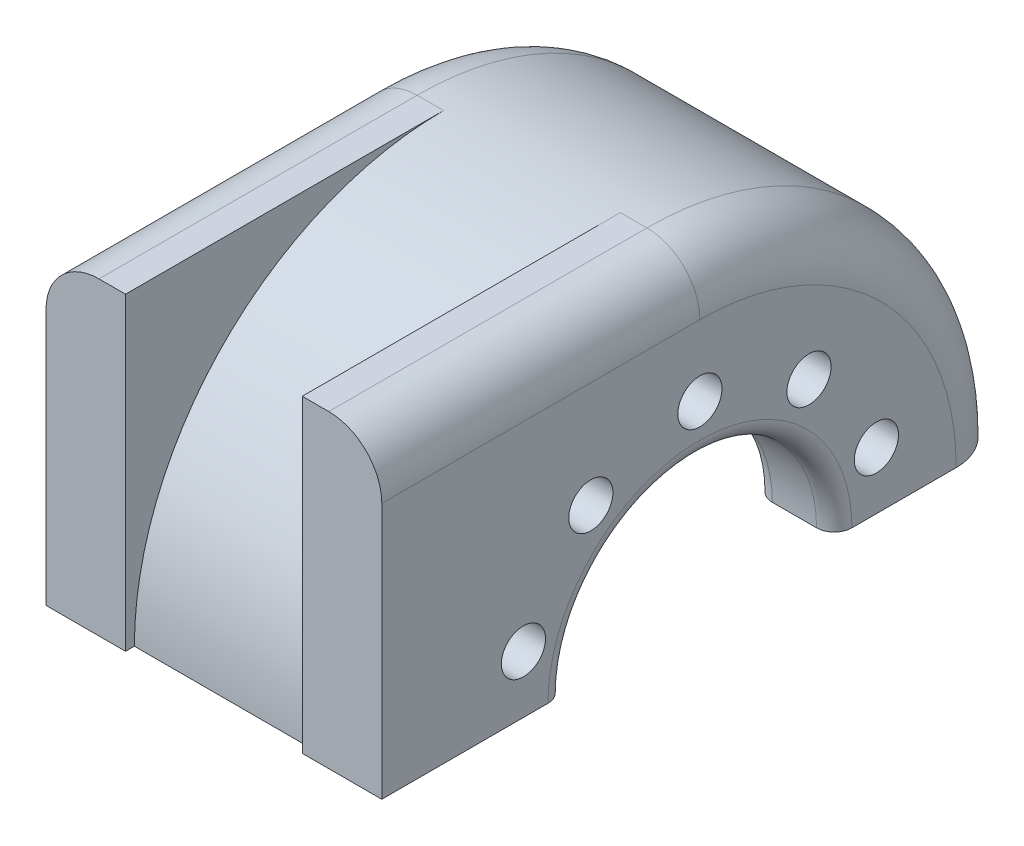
ISO-10303-21;
HEADER;
FILE_DESCRIPTION(('STEP AP214'),'2;1');
FILE_NAME('part.step','',(''),(''),'','','');
FILE_SCHEMA(('AUTOMOTIVE_DESIGN { 1 0 10303 214 1 1 1 1 }'));
ENDSEC;
DATA;
#1=APPLICATION_CONTEXT('core data for automotive mechanical design processes');
#2=APPLICATION_PROTOCOL_DEFINITION('international standard','automotive_design',2000,#1);
#3=PRODUCT_CONTEXT('',#1,'mechanical');
#4=PRODUCT('Part','Part','',(#3));
#5=PRODUCT_RELATED_PRODUCT_CATEGORY('part','',(#4));
#6=PRODUCT_DEFINITION_FORMATION('','',#4);
#7=PRODUCT_DEFINITION_CONTEXT('part definition',#1,'design');
#8=PRODUCT_DEFINITION('design','',#6,#7);
#9=PRODUCT_DEFINITION_SHAPE('','',#8);
#10=(LENGTH_UNIT() NAMED_UNIT(*) SI_UNIT(.MILLI.,.METRE.));
#11=(NAMED_UNIT(*) PLANE_ANGLE_UNIT() SI_UNIT($,.RADIAN.));
#12=(NAMED_UNIT(*) SI_UNIT($,.STERADIAN.) SOLID_ANGLE_UNIT());
#13=UNCERTAINTY_MEASURE_WITH_UNIT(LENGTH_MEASURE(1.E-05),#10,'distance_accuracy_value','');
#14=(GEOMETRIC_REPRESENTATION_CONTEXT(3) GLOBAL_UNCERTAINTY_ASSIGNED_CONTEXT((#13)) GLOBAL_UNIT_ASSIGNED_CONTEXT((#10,
#11,#12)) REPRESENTATION_CONTEXT('',''));
#15=CARTESIAN_POINT('',(0.,0.,0.));
#16=DIRECTION('',(0.,0.,1.));
#17=DIRECTION('',(1.,0.,0.));
#18=AXIS2_PLACEMENT_3D('',#15,#16,#17);
#19=CARTESIAN_POINT('',(-190.,175.,180.));
#20=DIRECTION('',(0.,1.,0.));
#21=DIRECTION('',(0.,0.,1.));
#22=AXIS2_PLACEMENT_3D('',#19,#20,#21);
#23=PLANE('',#22);
#24=DIRECTION('',(1.,0.,0.));
#25=VECTOR('',#24,1.);
#26=CARTESIAN_POINT('',(-190.,175.,180.));
#27=LINE('',#26,#25);
#28=CARTESIAN_POINT('',(-160.,175.,180.));
#29=VERTEX_POINT('',#28);
#30=CARTESIAN_POINT('',(-145.,175.,180.));
#31=VERTEX_POINT('',#30);
#32=EDGE_CURVE('E214',#29,#31,#27,.T.);
#33=ORIENTED_EDGE('',*,*,#32,.T.);
#34=DIRECTION('',(0.,0.,1.));
#35=VECTOR('',#34,1.);
#36=CARTESIAN_POINT('',(-145.,175.,0.));
#37=LINE('',#36,#35);
#38=CARTESIAN_POINT('',(-145.,175.,0.));
#39=VERTEX_POINT('',#38);
#40=EDGE_CURVE('E455',#39,#31,#37,.T.);
#41=ORIENTED_EDGE('',*,*,#40,.F.);
#42=DIRECTION('',(1.,0.,0.));
#43=VECTOR('',#42,1.);
#44=CARTESIAN_POINT('',(-190.,175.,0.));
#45=LINE('',#44,#43);
#46=CARTESIAN_POINT('',(-160.,175.,0.));
#47=VERTEX_POINT('',#46);
#48=EDGE_CURVE('E213',#47,#39,#45,.T.);
#49=ORIENTED_EDGE('',*,*,#48,.F.);
#50=DIRECTION('',(0.,0.,1.));
#51=VECTOR('',#50,1.);
#52=CARTESIAN_POINT('',(-160.,175.,180.));
#53=LINE('',#52,#51);
#54=EDGE_CURVE('E279',#47,#29,#53,.T.);
#55=ORIENTED_EDGE('',*,*,#54,.T.);
#56=EDGE_LOOP('',(#33,#41,#49,#55));
#57=FACE_BOUND('',#56,.T.);
#58=ADVANCED_FACE('F37',(#57),#23,.T.);
#59=CARTESIAN_POINT('',(-190.,175.,180.));
#60=DIRECTION('',(0.,0.,1.));
#61=DIRECTION('',(0.,-1.,0.));
#62=AXIS2_PLACEMENT_3D('',#59,#60,#61);
#63=PLANE('',#62);
#64=DIRECTION('',(1.,0.,0.));
#65=VECTOR('',#64,1.);
#66=CARTESIAN_POINT('',(-190.,0.,180.));
#67=LINE('',#66,#65);
#68=CARTESIAN_POINT('',(-190.,0.,180.));
#69=VERTEX_POINT('',#68);
#70=CARTESIAN_POINT('',(-145.,0.,180.));
#71=VERTEX_POINT('',#70);
#72=EDGE_CURVE('E343',#69,#71,#67,.T.);
#73=ORIENTED_EDGE('',*,*,#72,.T.);
#74=DIRECTION('',(0.,-1.,0.));
#75=VECTOR('',#74,1.);
#76=CARTESIAN_POINT('',(-145.,175.,180.));
#77=LINE('',#76,#75);
#78=EDGE_CURVE('E54',#31,#71,#77,.T.);
#79=ORIENTED_EDGE('',*,*,#78,.F.);
#80=ORIENTED_EDGE('',*,*,#32,.F.);
#81=CARTESIAN_POINT('',(-160.,145.,180.));
#82=DIRECTION('',(0.,0.,1.));
#83=DIRECTION('',(0.,-1.,0.));
#84=AXIS2_PLACEMENT_3D('',#81,#82,#83);
#85=CIRCLE('',#84,30.);
#86=CARTESIAN_POINT('',(-190.,145.,180.));
#87=VERTEX_POINT('',#86);
#88=EDGE_CURVE('E285',#29,#87,#85,.T.);
#89=ORIENTED_EDGE('',*,*,#88,.T.);
#90=DIRECTION('',(0.,-1.,0.));
#91=VECTOR('',#90,1.);
#92=CARTESIAN_POINT('',(-190.,175.,180.));
#93=LINE('',#92,#91);
#94=EDGE_CURVE('E374',#87,#69,#93,.T.);
#95=ORIENTED_EDGE('',*,*,#94,.T.);
#96=EDGE_LOOP('',(#73,#79,#80,#89,#95));
#97=FACE_BOUND('',#96,.T.);
#98=ADVANCED_FACE('F474',(#97),#63,.T.);
#99=CARTESIAN_POINT('',(-190.,0.,0.));
#100=DIRECTION('',(1.,0.,0.));
#101=DIRECTION('',(0.,0.,-1.));
#102=AXIS2_PLACEMENT_3D('',#99,#100,#101);
#103=CYLINDRICAL_SURFACE('',#102,175.);
#104=DIRECTION('',(1.,0.,0.));
#105=VECTOR('',#104,1.);
#106=CARTESIAN_POINT('',(-190.,0.,-175.));
#107=LINE('',#106,#105);
#108=CARTESIAN_POINT('',(-160.,0.,-175.));
#109=VERTEX_POINT('',#108);
#110=CARTESIAN_POINT('',(-30.,0.,-175.));
#111=VERTEX_POINT('',#110);
#112=EDGE_CURVE('E339',#109,#111,#107,.T.);
#113=ORIENTED_EDGE('',*,*,#112,.F.);
#114=CARTESIAN_POINT('',(-160.,0.,0.));
#115=DIRECTION('',(1.,0.,0.));
#116=DIRECTION('',(0.,0.,-1.));
#117=AXIS2_PLACEMENT_3D('',#114,#115,#116);
#118=CIRCLE('',#117,175.);
#119=EDGE_CURVE('E293',#109,#47,#118,.T.);
#120=ORIENTED_EDGE('',*,*,#119,.T.);
#121=ORIENTED_EDGE('',*,*,#48,.T.);
#122=CARTESIAN_POINT('',(-145.,0.,0.));
#123=DIRECTION('',(-1.,0.,0.));
#124=DIRECTION('',(0.,0.,-1.));
#125=AXIS2_PLACEMENT_3D('',#122,#123,#124);
#126=CIRCLE('',#125,175.);
#127=CARTESIAN_POINT('',(-145.,0.,175.));
#128=VERTEX_POINT('',#127);
#129=EDGE_CURVE('E456',#128,#39,#126,.T.);
#130=ORIENTED_EDGE('',*,*,#129,.F.);
#131=DIRECTION('',(-1.,0.,0.));
#132=VECTOR('',#131,1.);
#133=CARTESIAN_POINT('',(-45.,0.,175.));
#134=LINE('',#133,#132);
#135=CARTESIAN_POINT('',(-45.,0.,175.));
#136=VERTEX_POINT('',#135);
#137=EDGE_CURVE('E207',#136,#128,#134,.T.);
#138=ORIENTED_EDGE('',*,*,#137,.F.);
#139=CARTESIAN_POINT('',(-45.,0.,0.));
#140=DIRECTION('',(-1.,0.,0.));
#141=DIRECTION('',(0.,0.,-1.));
#142=AXIS2_PLACEMENT_3D('',#139,#140,#141);
#143=CIRCLE('',#142,175.);
#144=CARTESIAN_POINT('',(-45.,175.,0.));
#145=VERTEX_POINT('',#144);
#146=EDGE_CURVE('E192',#136,#145,#143,.T.);
#147=ORIENTED_EDGE('',*,*,#146,.T.);
#148=CARTESIAN_POINT('',(-30.,175.,0.));
#149=VERTEX_POINT('',#148);
#150=EDGE_CURVE('E203',#145,#149,#45,.T.);
#151=ORIENTED_EDGE('',*,*,#150,.T.);
#152=CARTESIAN_POINT('',(-30.,0.,0.));
#153=DIRECTION('',(1.,0.,0.));
#154=DIRECTION('',(0.,0.,-1.));
#155=AXIS2_PLACEMENT_3D('',#152,#153,#154);
#156=CIRCLE('',#155,175.);
#157=EDGE_CURVE('E291',#149,#111,#156,.F.);
#158=ORIENTED_EDGE('',*,*,#157,.T.);
#159=EDGE_LOOP('',(#113,#120,#121,#130,#138,#147,#151,#158));
#160=FACE_BOUND('',#159,.T.);
#161=ADVANCED_FACE('F202',(#160),#103,.T.);
#162=CARTESIAN_POINT('',(-190.,0.,0.));
#163=DIRECTION('',(1.,0.,0.));
#164=DIRECTION('',(0.,0.,-1.));
#165=AXIS2_PLACEMENT_3D('',#162,#163,#164);
#166=CYLINDRICAL_SURFACE('',#165,76.);
#167=DIRECTION('',(1.,0.,0.));
#168=VECTOR('',#167,1.);
#169=CARTESIAN_POINT('',(-190.,0.,-76.));
#170=LINE('',#169,#168);
#171=CARTESIAN_POINT('',(-35.,0.,-76.));
#172=VERTEX_POINT('',#171);
#173=CARTESIAN_POINT('',(-10.,0.,-76.));
#174=VERTEX_POINT('',#173);
#175=EDGE_CURVE('E363',#172,#174,#170,.T.);
#176=ORIENTED_EDGE('',*,*,#175,.T.);
#177=CARTESIAN_POINT('',(-10.,0.,0.));
#178=DIRECTION('',(1.,0.,0.));
#179=DIRECTION('',(0.,0.,-1.));
#180=AXIS2_PLACEMENT_3D('',#177,#178,#179);
#181=CIRCLE('',#180,76.);
#182=CARTESIAN_POINT('',(-10.,0.,76.));
#183=VERTEX_POINT('',#182);
#184=EDGE_CURVE('E268',#174,#183,#181,.T.);
#185=ORIENTED_EDGE('',*,*,#184,.T.);
#186=DIRECTION('',(1.,0.,0.));
#187=VECTOR('',#186,1.);
#188=CARTESIAN_POINT('',(-190.,0.,76.));
#189=LINE('',#188,#187);
#190=CARTESIAN_POINT('',(-35.,0.,76.));
#191=VERTEX_POINT('',#190);
#192=EDGE_CURVE('E358',#183,#191,#189,.F.);
#193=ORIENTED_EDGE('',*,*,#192,.T.);
#194=CARTESIAN_POINT('',(-35.,0.,0.));
#195=DIRECTION('',(-1.,0.,0.));
#196=DIRECTION('',(0.,0.,1.));
#197=AXIS2_PLACEMENT_3D('',#194,#195,#196);
#198=CIRCLE('',#197,76.);
#199=EDGE_CURVE('E264',#191,#172,#198,.T.);
#200=ORIENTED_EDGE('',*,*,#199,.T.);
#201=EDGE_LOOP('',(#176,#185,#193,#200));
#202=FACE_BOUND('',#201,.T.);
#203=ADVANCED_FACE('F397',(#202),#166,.F.);
#204=DIRECTION('',(0.,0.,1.));
#205=VECTOR('',#204,1.);
#206=CARTESIAN_POINT('',(-45.,175.,0.));
#207=LINE('',#206,#205);
#208=CARTESIAN_POINT('',(-45.,175.,180.));
#209=VERTEX_POINT('',#208);
#210=EDGE_CURVE('E189',#145,#209,#207,.T.);
#211=ORIENTED_EDGE('',*,*,#210,.T.);
#212=CARTESIAN_POINT('',(-30.,175.,180.));
#213=VERTEX_POINT('',#212);
#214=EDGE_CURVE('E219',#209,#213,#27,.T.);
#215=ORIENTED_EDGE('',*,*,#214,.T.);
#216=DIRECTION('',(0.,0.,1.));
#217=VECTOR('',#216,1.);
#218=CARTESIAN_POINT('',(-30.,175.,180.));
#219=LINE('',#218,#217);
#220=EDGE_CURVE('E212',#213,#149,#219,.F.);
#221=ORIENTED_EDGE('',*,*,#220,.T.);
#222=ORIENTED_EDGE('',*,*,#150,.F.);
#223=EDGE_LOOP('',(#211,#215,#221,#222));
#224=FACE_BOUND('',#223,.T.);
#225=ADVANCED_FACE('F210',(#224),#23,.T.);
#226=DIRECTION('',(0.,-1.,0.));
#227=VECTOR('',#226,1.);
#228=CARTESIAN_POINT('',(-45.,175.,180.));
#229=LINE('',#228,#227);
#230=CARTESIAN_POINT('',(-45.,0.,180.));
#231=VERTEX_POINT('',#230);
#232=EDGE_CURVE('E195',#209,#231,#229,.T.);
#233=ORIENTED_EDGE('',*,*,#232,.T.);
#234=CARTESIAN_POINT('',(0.,0.,180.));
#235=VERTEX_POINT('',#234);
#236=EDGE_CURVE('E347',#231,#235,#67,.T.);
#237=ORIENTED_EDGE('',*,*,#236,.T.);
#238=DIRECTION('',(0.,-1.,0.));
#239=VECTOR('',#238,1.);
#240=CARTESIAN_POINT('',(0.,175.,180.));
#241=LINE('',#240,#239);
#242=CARTESIAN_POINT('',(0.,145.,180.));
#243=VERTEX_POINT('',#242);
#244=EDGE_CURVE('E222',#243,#235,#241,.T.);
#245=ORIENTED_EDGE('',*,*,#244,.F.);
#246=CARTESIAN_POINT('',(-30.,145.,180.));
#247=DIRECTION('',(0.,0.,1.));
#248=DIRECTION('',(0.,-1.,0.));
#249=AXIS2_PLACEMENT_3D('',#246,#247,#248);
#250=CIRCLE('',#249,30.);
#251=EDGE_CURVE('E282',#243,#213,#250,.T.);
#252=ORIENTED_EDGE('',*,*,#251,.T.);
#253=ORIENTED_EDGE('',*,*,#214,.F.);
#254=EDGE_LOOP('',(#233,#237,#245,#252,#253));
#255=FACE_BOUND('',#254,.T.);
#256=ADVANCED_FACE('F460',(#255),#63,.T.);
#257=CARTESIAN_POINT('',(-190.,0.,0.));
#258=DIRECTION('',(1.,0.,0.));
#259=DIRECTION('',(0.,0.,-1.));
#260=AXIS2_PLACEMENT_3D('',#257,#258,#259);
#261=PLANE('',#260);
#262=ORIENTED_EDGE('',*,*,#94,.F.);
#263=DIRECTION('',(0.,0.,1.));
#264=VECTOR('',#263,1.);
#265=CARTESIAN_POINT('',(-190.,145.,0.));
#266=LINE('',#265,#264);
#267=CARTESIAN_POINT('',(-190.,145.,0.));
#268=VERTEX_POINT('',#267);
#269=EDGE_CURVE('E289',#87,#268,#266,.F.);
#270=ORIENTED_EDGE('',*,*,#269,.T.);
#271=CARTESIAN_POINT('',(-190.,0.,0.));
#272=DIRECTION('',(1.,0.,0.));
#273=DIRECTION('',(0.,0.,-1.));
#274=AXIS2_PLACEMENT_3D('',#271,#272,#273);
#275=CIRCLE('',#274,145.);
#276=CARTESIAN_POINT('',(-190.,0.,-145.));
#277=VERTEX_POINT('',#276);
#278=EDGE_CURVE('E287',#268,#277,#275,.F.);
#279=ORIENTED_EDGE('',*,*,#278,.T.);
#280=DIRECTION('',(0.,0.,1.));
#281=VECTOR('',#280,1.);
#282=CARTESIAN_POINT('',(-190.,0.,180.));
#283=LINE('',#282,#281);
#284=CARTESIAN_POINT('',(-190.,0.,-101.));
#285=VERTEX_POINT('',#284);
#286=EDGE_CURVE('E337',#277,#285,#283,.T.);
#287=ORIENTED_EDGE('',*,*,#286,.T.);
#288=CARTESIAN_POINT('',(-190.,0.,0.));
#289=DIRECTION('',(-1.,0.,0.));
#290=DIRECTION('',(0.,0.,1.));
#291=AXIS2_PLACEMENT_3D('',#288,#289,#290);
#292=CIRCLE('',#291,101.);
#293=CARTESIAN_POINT('',(-190.,0.,101.));
#294=VERTEX_POINT('',#293);
#295=EDGE_CURVE('E372',#294,#285,#292,.T.);
#296=ORIENTED_EDGE('',*,*,#295,.F.);
#297=EDGE_CURVE('E340',#294,#69,#283,.T.);
#298=ORIENTED_EDGE('',*,*,#297,.T.);
#299=EDGE_LOOP('',(#262,#270,#279,#287,#296,#298));
#300=FACE_BOUND('',#299,.T.);
#301=ADVANCED_FACE('F445',(#300),#261,.F.);
#302=CARTESIAN_POINT('',(0.,0.,0.));
#303=DIRECTION('',(1.,0.,0.));
#304=DIRECTION('',(0.,0.,-1.));
#305=AXIS2_PLACEMENT_3D('',#302,#303,#304);
#306=PLANE('',#305);
#307=CARTESIAN_POINT('',(0.,84.9467844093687,61.7174514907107));
#308=DIRECTION('',(1.,0.,0.));
#309=DIRECTION('',(0.,0.,-1.));
#310=AXIS2_PLACEMENT_3D('',#307,#308,#309);
#311=CIRCLE('',#310,12.5);
#312=CARTESIAN_POINT('',(0.,84.9467844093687,49.2174514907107));
#313=VERTEX_POINT('',#312);
#314=EDGE_CURVE('E301',#313,#313,#311,.T.);
#315=ORIENTED_EDGE('',*,*,#314,.F.);
#316=EDGE_LOOP('',(#315));
#317=FACE_BOUND('',#316,.T.);
#318=CARTESIAN_POINT('',(0.,105.,1.11716191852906E-12));
#319=DIRECTION('',(1.,0.,0.));
#320=DIRECTION('',(0.,0.,-1.));
#321=AXIS2_PLACEMENT_3D('',#318,#319,#320);
#322=CIRCLE('',#321,12.5);
#323=CARTESIAN_POINT('',(0.,105.,-12.4999999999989));
#324=VERTEX_POINT('',#323);
#325=EDGE_CURVE('E318',#324,#324,#322,.T.);
#326=ORIENTED_EDGE('',*,*,#325,.F.);
#327=EDGE_LOOP('',(#326));
#328=FACE_BOUND('',#327,.T.);
#329=CARTESIAN_POINT('',(0.,84.94678440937,-61.7174514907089));
#330=DIRECTION('',(1.,0.,0.));
#331=DIRECTION('',(0.,0.,-1.));
#332=AXIS2_PLACEMENT_3D('',#329,#330,#331);
#333=CIRCLE('',#332,12.5);
#334=CARTESIAN_POINT('',(0.,84.94678440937,-74.2174514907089));
#335=VERTEX_POINT('',#334);
#336=EDGE_CURVE('E324',#335,#335,#333,.T.);
#337=ORIENTED_EDGE('',*,*,#336,.F.);
#338=EDGE_LOOP('',(#337));
#339=FACE_BOUND('',#338,.T.);
#340=CARTESIAN_POINT('',(0.,32.4467844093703,-99.8609342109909));
#341=DIRECTION('',(1.,0.,0.));
#342=DIRECTION('',(0.,0.,-1.));
#343=AXIS2_PLACEMENT_3D('',#340,#341,#342);
#344=CIRCLE('',#343,12.5);
#345=CARTESIAN_POINT('',(0.,32.4467844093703,-112.360934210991));
#346=VERTEX_POINT('',#345);
#347=EDGE_CURVE('E330',#346,#346,#344,.T.);
#348=ORIENTED_EDGE('',*,*,#347,.F.);
#349=EDGE_LOOP('',(#348));
#350=FACE_BOUND('',#349,.T.);
#351=DIRECTION('',(0.,0.,1.));
#352=VECTOR('',#351,1.);
#353=CARTESIAN_POINT('',(0.,0.,180.));
#354=LINE('',#353,#352);
#355=CARTESIAN_POINT('',(0.,0.,-145.));
#356=VERTEX_POINT('',#355);
#357=CARTESIAN_POINT('',(0.,0.,-86.));
#358=VERTEX_POINT('',#357);
#359=EDGE_CURVE('E341',#356,#358,#354,.T.);
#360=ORIENTED_EDGE('',*,*,#359,.F.);
#361=CARTESIAN_POINT('',(0.,0.,0.));
#362=DIRECTION('',(1.,0.,0.));
#363=DIRECTION('',(0.,0.,-1.));
#364=AXIS2_PLACEMENT_3D('',#361,#362,#363);
#365=CIRCLE('',#364,145.);
#366=CARTESIAN_POINT('',(0.,145.,0.));
#367=VERTEX_POINT('',#366);
#368=EDGE_CURVE('E11',#356,#367,#365,.T.);
#369=ORIENTED_EDGE('',*,*,#368,.T.);
#370=DIRECTION('',(0.,0.,1.));
#371=VECTOR('',#370,1.);
#372=CARTESIAN_POINT('',(0.,145.,0.));
#373=LINE('',#372,#371);
#374=EDGE_CURVE('E46',#367,#243,#373,.T.);
#375=ORIENTED_EDGE('',*,*,#374,.T.);
#376=ORIENTED_EDGE('',*,*,#244,.T.);
#377=CARTESIAN_POINT('',(0.,0.,86.));
#378=VERTEX_POINT('',#377);
#379=EDGE_CURVE('E336',#378,#235,#354,.T.);
#380=ORIENTED_EDGE('',*,*,#379,.F.);
#381=CARTESIAN_POINT('',(0.,0.,0.));
#382=DIRECTION('',(1.,0.,0.));
#383=DIRECTION('',(0.,0.,-1.));
#384=AXIS2_PLACEMENT_3D('',#381,#382,#383);
#385=CIRCLE('',#384,86.);
#386=EDGE_CURVE('E273',#378,#358,#385,.F.);
#387=ORIENTED_EDGE('',*,*,#386,.T.);
#388=EDGE_LOOP('',(#360,#369,#375,#376,#380,#387));
#389=FACE_BOUND('',#388,.T.);
#390=CARTESIAN_POINT('',(0.,32.4467844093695,99.8609342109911));
#391=DIRECTION('',(1.,0.,0.));
#392=DIRECTION('',(0.,0.,-1.));
#393=AXIS2_PLACEMENT_3D('',#390,#391,#392);
#394=CIRCLE('',#393,12.5);
#395=CARTESIAN_POINT('',(0.,32.4467844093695,87.3609342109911));
#396=VERTEX_POINT('',#395);
#397=EDGE_CURVE('E366',#396,#396,#394,.T.);
#398=ORIENTED_EDGE('',*,*,#397,.F.);
#399=EDGE_LOOP('',(#398));
#400=FACE_BOUND('',#399,.T.);
#401=ADVANCED_FACE('F384',(#317,#328,#339,#350,#389,#400),#306,.T.);
#402=CARTESIAN_POINT('',(-145.,0.,0.));
#403=DIRECTION('',(-1.,0.,0.));
#404=DIRECTION('',(0.,0.,1.));
#405=AXIS2_PLACEMENT_3D('',#402,#403,#404);
#406=CYLINDRICAL_SURFACE('',#405,101.);
#407=DIRECTION('',(-1.,0.,0.));
#408=VECTOR('',#407,1.);
#409=CARTESIAN_POINT('',(-145.,0.,-101.));
#410=LINE('',#409,#408);
#411=CARTESIAN_POINT('',(-150.,0.,-101.));
#412=VERTEX_POINT('',#411);
#413=EDGE_CURVE('E360',#285,#412,#410,.F.);
#414=ORIENTED_EDGE('',*,*,#413,.T.);
#415=CARTESIAN_POINT('',(-150.,0.,0.));
#416=DIRECTION('',(-1.,0.,0.));
#417=DIRECTION('',(0.,0.,1.));
#418=AXIS2_PLACEMENT_3D('',#415,#416,#417);
#419=CIRCLE('',#418,101.);
#420=CARTESIAN_POINT('',(-150.,0.,101.));
#421=VERTEX_POINT('',#420);
#422=EDGE_CURVE('E230',#412,#421,#419,.F.);
#423=ORIENTED_EDGE('',*,*,#422,.T.);
#424=DIRECTION('',(-1.,0.,0.));
#425=VECTOR('',#424,1.);
#426=CARTESIAN_POINT('',(-145.,0.,101.));
#427=LINE('',#426,#425);
#428=EDGE_CURVE('E355',#421,#294,#427,.T.);
#429=ORIENTED_EDGE('',*,*,#428,.T.);
#430=ORIENTED_EDGE('',*,*,#295,.T.);
#431=EDGE_LOOP('',(#414,#423,#429,#430));
#432=FACE_BOUND('',#431,.T.);
#433=ADVANCED_FACE('F439',(#432),#406,.F.);
#434=CARTESIAN_POINT('',(-45.,0.,0.));
#435=DIRECTION('',(-1.,0.,0.));
#436=DIRECTION('',(0.,0.,1.));
#437=AXIS2_PLACEMENT_3D('',#434,#435,#436);
#438=PLANE('',#437);
#439=CARTESIAN_POINT('',(-45.,84.9467844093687,61.7174514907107));
#440=DIRECTION('',(1.,0.,0.));
#441=DIRECTION('',(0.,0.,-1.));
#442=AXIS2_PLACEMENT_3D('',#439,#440,#441);
#443=CIRCLE('',#442,12.5);
#444=CARTESIAN_POINT('',(-45.,84.9467844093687,49.2174514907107));
#445=VERTEX_POINT('',#444);
#446=EDGE_CURVE('E307',#445,#445,#443,.T.);
#447=ORIENTED_EDGE('',*,*,#446,.T.);
#448=EDGE_LOOP('',(#447));
#449=FACE_BOUND('',#448,.T.);
#450=CARTESIAN_POINT('',(-45.,105.,1.11716191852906E-12));
#451=DIRECTION('',(1.,0.,0.));
#452=DIRECTION('',(0.,0.,-1.));
#453=AXIS2_PLACEMENT_3D('',#450,#451,#452);
#454=CIRCLE('',#453,12.5);
#455=CARTESIAN_POINT('',(-45.,105.,-12.4999999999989));
#456=VERTEX_POINT('',#455);
#457=EDGE_CURVE('E321',#456,#456,#454,.T.);
#458=ORIENTED_EDGE('',*,*,#457,.T.);
#459=EDGE_LOOP('',(#458));
#460=FACE_BOUND('',#459,.T.);
#461=CARTESIAN_POINT('',(-45.,84.94678440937,-61.7174514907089));
#462=DIRECTION('',(1.,0.,0.));
#463=DIRECTION('',(0.,0.,-1.));
#464=AXIS2_PLACEMENT_3D('',#461,#462,#463);
#465=CIRCLE('',#464,12.5);
#466=CARTESIAN_POINT('',(-45.,84.94678440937,-74.2174514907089));
#467=VERTEX_POINT('',#466);
#468=EDGE_CURVE('E327',#467,#467,#465,.T.);
#469=ORIENTED_EDGE('',*,*,#468,.T.);
#470=EDGE_LOOP('',(#469));
#471=FACE_BOUND('',#470,.T.);
#472=CARTESIAN_POINT('',(-45.,32.4467844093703,-99.8609342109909));
#473=DIRECTION('',(1.,0.,0.));
#474=DIRECTION('',(0.,0.,-1.));
#475=AXIS2_PLACEMENT_3D('',#472,#473,#474);
#476=CIRCLE('',#475,12.5);
#477=CARTESIAN_POINT('',(-45.,32.4467844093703,-112.360934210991));
#478=VERTEX_POINT('',#477);
#479=EDGE_CURVE('E333',#478,#478,#476,.T.);
#480=ORIENTED_EDGE('',*,*,#479,.T.);
#481=EDGE_LOOP('',(#480));
#482=FACE_BOUND('',#481,.T.);
#483=DIRECTION('',(0.,0.,-1.));
#484=VECTOR('',#483,1.);
#485=CARTESIAN_POINT('',(-45.,0.,0.));
#486=LINE('',#485,#484);
#487=CARTESIAN_POINT('',(-45.,0.,-86.));
#488=VERTEX_POINT('',#487);
#489=CARTESIAN_POINT('',(-45.,0.,-126.));
#490=VERTEX_POINT('',#489);
#491=EDGE_CURVE('E356',#488,#490,#486,.T.);
#492=ORIENTED_EDGE('',*,*,#491,.F.);
#493=CARTESIAN_POINT('',(-45.,0.,0.));
#494=DIRECTION('',(-1.,0.,0.));
#495=DIRECTION('',(0.,0.,1.));
#496=AXIS2_PLACEMENT_3D('',#493,#494,#495);
#497=CIRCLE('',#496,86.);
#498=CARTESIAN_POINT('',(-45.,0.,86.));
#499=VERTEX_POINT('',#498);
#500=EDGE_CURVE('E258',#488,#499,#497,.F.);
#501=ORIENTED_EDGE('',*,*,#500,.T.);
#502=CARTESIAN_POINT('',(-45.,0.,126.));
#503=VERTEX_POINT('',#502);
#504=EDGE_CURVE('E351',#503,#499,#486,.T.);
#505=ORIENTED_EDGE('',*,*,#504,.F.);
#506=CARTESIAN_POINT('',(-45.,0.,0.));
#507=DIRECTION('',(-1.,0.,0.));
#508=DIRECTION('',(0.,0.,1.));
#509=AXIS2_PLACEMENT_3D('',#506,#507,#508);
#510=CIRCLE('',#509,126.);
#511=EDGE_CURVE('E240',#503,#490,#510,.T.);
#512=ORIENTED_EDGE('',*,*,#511,.T.);
#513=EDGE_LOOP('',(#492,#501,#505,#512));
#514=FACE_BOUND('',#513,.T.);
#515=CARTESIAN_POINT('',(-45.,32.4467844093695,99.8609342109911));
#516=DIRECTION('',(1.,0.,0.));
#517=DIRECTION('',(0.,0.,-1.));
#518=AXIS2_PLACEMENT_3D('',#515,#516,#517);
#519=CIRCLE('',#518,12.5);
#520=CARTESIAN_POINT('',(-45.,32.4467844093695,87.3609342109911));
#521=VERTEX_POINT('',#520);
#522=EDGE_CURVE('E369',#521,#521,#519,.T.);
#523=ORIENTED_EDGE('',*,*,#522,.T.);
#524=EDGE_LOOP('',(#523));
#525=FACE_BOUND('',#524,.T.);
#526=ADVANCED_FACE('F410',(#449,#460,#471,#482,#514,#525),#438,.T.);
#527=CARTESIAN_POINT('',(-145.,0.,0.));
#528=DIRECTION('',(-1.,0.,0.));
#529=DIRECTION('',(0.,0.,1.));
#530=AXIS2_PLACEMENT_3D('',#527,#528,#529);
#531=PLANE('',#530);
#532=DIRECTION('',(0.,0.,-1.));
#533=VECTOR('',#532,1.);
#534=CARTESIAN_POINT('',(-145.,0.,0.));
#535=LINE('',#534,#533);
#536=CARTESIAN_POINT('',(-145.,0.,-106.));
#537=VERTEX_POINT('',#536);
#538=CARTESIAN_POINT('',(-145.,0.,-126.));
#539=VERTEX_POINT('',#538);
#540=EDGE_CURVE('E352',#537,#539,#535,.T.);
#541=ORIENTED_EDGE('',*,*,#540,.T.);
#542=CARTESIAN_POINT('',(-145.,0.,0.));
#543=DIRECTION('',(-1.,0.,0.));
#544=DIRECTION('',(0.,0.,1.));
#545=AXIS2_PLACEMENT_3D('',#542,#543,#544);
#546=CIRCLE('',#545,126.);
#547=CARTESIAN_POINT('',(-145.,0.,126.));
#548=VERTEX_POINT('',#547);
#549=EDGE_CURVE('E248',#539,#548,#546,.F.);
#550=ORIENTED_EDGE('',*,*,#549,.T.);
#551=CARTESIAN_POINT('',(-145.,0.,106.));
#552=VERTEX_POINT('',#551);
#553=EDGE_CURVE('E346',#548,#552,#535,.T.);
#554=ORIENTED_EDGE('',*,*,#553,.T.);
#555=CARTESIAN_POINT('',(-145.,0.,0.));
#556=DIRECTION('',(-1.,0.,0.));
#557=DIRECTION('',(0.,0.,1.));
#558=AXIS2_PLACEMENT_3D('',#555,#556,#557);
#559=CIRCLE('',#558,106.);
#560=EDGE_CURVE('E236',#552,#537,#559,.T.);
#561=ORIENTED_EDGE('',*,*,#560,.T.);
#562=EDGE_LOOP('',(#541,#550,#554,#561));
#563=FACE_BOUND('',#562,.T.);
#564=ADVANCED_FACE('F431',(#563),#531,.F.);
#565=CARTESIAN_POINT('',(-45.,0.,0.));
#566=DIRECTION('',(-1.,0.,0.));
#567=DIRECTION('',(0.,0.,1.));
#568=AXIS2_PLACEMENT_3D('',#565,#566,#567);
#569=CYLINDRICAL_SURFACE('',#568,131.);
#570=DIRECTION('',(-1.,0.,0.));
#571=VECTOR('',#570,1.);
#572=CARTESIAN_POINT('',(-45.,0.,-131.));
#573=LINE('',#572,#571);
#574=CARTESIAN_POINT('',(-140.,0.,-131.));
#575=VERTEX_POINT('',#574);
#576=CARTESIAN_POINT('',(-50.,0.,-131.));
#577=VERTEX_POINT('',#576);
#578=EDGE_CURVE('E227',#575,#577,#573,.F.);
#579=ORIENTED_EDGE('',*,*,#578,.T.);
#580=CARTESIAN_POINT('',(-50.,0.,0.));
#581=DIRECTION('',(-1.,0.,0.));
#582=DIRECTION('',(0.,0.,1.));
#583=AXIS2_PLACEMENT_3D('',#580,#581,#582);
#584=CIRCLE('',#583,131.);
#585=CARTESIAN_POINT('',(-50.,0.,131.));
#586=VERTEX_POINT('',#585);
#587=EDGE_CURVE('E246',#577,#586,#584,.F.);
#588=ORIENTED_EDGE('',*,*,#587,.T.);
#589=DIRECTION('',(-1.,0.,0.));
#590=VECTOR('',#589,1.);
#591=CARTESIAN_POINT('',(-45.,0.,131.));
#592=LINE('',#591,#590);
#593=CARTESIAN_POINT('',(-140.,0.,131.));
#594=VERTEX_POINT('',#593);
#595=EDGE_CURVE('E217',#586,#594,#592,.T.);
#596=ORIENTED_EDGE('',*,*,#595,.T.);
#597=CARTESIAN_POINT('',(-140.,0.,0.));
#598=DIRECTION('',(-1.,0.,0.));
#599=DIRECTION('',(0.,0.,1.));
#600=AXIS2_PLACEMENT_3D('',#597,#598,#599);
#601=CIRCLE('',#600,131.);
#602=EDGE_CURVE('E243',#594,#575,#601,.T.);
#603=ORIENTED_EDGE('',*,*,#602,.T.);
#604=EDGE_LOOP('',(#579,#588,#596,#603));
#605=FACE_BOUND('',#604,.T.);
#606=ADVANCED_FACE('F421',(#605),#569,.F.);
#607=CARTESIAN_POINT('',(0.,32.4467844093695,99.8609342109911));
#608=DIRECTION('',(1.,0.,0.));
#609=DIRECTION('',(0.,0.,-1.));
#610=AXIS2_PLACEMENT_3D('',#607,#608,#609);
#611=CYLINDRICAL_SURFACE('',#610,12.5);
#612=ORIENTED_EDGE('',*,*,#522,.F.);
#613=EDGE_LOOP('',(#612));
#614=FACE_BOUND('',#613,.T.);
#615=ORIENTED_EDGE('',*,*,#397,.T.);
#616=EDGE_LOOP('',(#615));
#617=FACE_BOUND('',#616,.T.);
#618=ADVANCED_FACE('F527',(#614,#617),#611,.F.);
#619=CARTESIAN_POINT('',(-190.,0.,180.));
#620=DIRECTION('',(0.,1.,0.));
#621=DIRECTION('',(0.,0.,1.));
#622=AXIS2_PLACEMENT_3D('',#619,#620,#621);
#623=PLANE('',#622);
#624=ORIENTED_EDGE('',*,*,#236,.F.);
#625=DIRECTION('',(0.,0.,-1.));
#626=VECTOR('',#625,1.);
#627=CARTESIAN_POINT('',(-45.,0.,180.));
#628=LINE('',#627,#626);
#629=EDGE_CURVE('E309',#231,#136,#628,.T.);
#630=ORIENTED_EDGE('',*,*,#629,.T.);
#631=ORIENTED_EDGE('',*,*,#137,.T.);
#632=DIRECTION('',(0.,0.,-1.));
#633=VECTOR('',#632,1.);
#634=CARTESIAN_POINT('',(-145.,0.,180.));
#635=LINE('',#634,#633);
#636=EDGE_CURVE('E208',#71,#128,#635,.T.);
#637=ORIENTED_EDGE('',*,*,#636,.F.);
#638=ORIENTED_EDGE('',*,*,#72,.F.);
#639=ORIENTED_EDGE('',*,*,#297,.F.);
#640=ORIENTED_EDGE('',*,*,#428,.F.);
#641=CARTESIAN_POINT('',(-150.,0.,106.));
#642=DIRECTION('',(0.,1.,0.));
#643=DIRECTION('',(0.,0.,1.));
#644=AXIS2_PLACEMENT_3D('',#641,#642,#643);
#645=CIRCLE('',#644,5.);
#646=EDGE_CURVE('E233',#421,#552,#645,.F.);
#647=ORIENTED_EDGE('',*,*,#646,.T.);
#648=ORIENTED_EDGE('',*,*,#553,.F.);
#649=CARTESIAN_POINT('',(-140.,0.,126.));
#650=DIRECTION('',(0.,1.,0.));
#651=DIRECTION('',(0.,0.,1.));
#652=AXIS2_PLACEMENT_3D('',#649,#650,#651);
#653=CIRCLE('',#652,5.);
#654=EDGE_CURVE('E256',#548,#594,#653,.T.);
#655=ORIENTED_EDGE('',*,*,#654,.T.);
#656=ORIENTED_EDGE('',*,*,#595,.F.);
#657=CARTESIAN_POINT('',(-50.,0.,126.));
#658=DIRECTION('',(0.,1.,0.));
#659=DIRECTION('',(0.,0.,1.));
#660=AXIS2_PLACEMENT_3D('',#657,#658,#659);
#661=CIRCLE('',#660,5.);
#662=EDGE_CURVE('E252',#586,#503,#661,.T.);
#663=ORIENTED_EDGE('',*,*,#662,.T.);
#664=ORIENTED_EDGE('',*,*,#504,.T.);
#665=CARTESIAN_POINT('',(-35.,0.,86.));
#666=DIRECTION('',(0.,1.,0.));
#667=DIRECTION('',(0.,0.,1.));
#668=AXIS2_PLACEMENT_3D('',#665,#666,#667);
#669=CIRCLE('',#668,10.);
#670=EDGE_CURVE('E261',#499,#191,#669,.F.);
#671=ORIENTED_EDGE('',*,*,#670,.T.);
#672=ORIENTED_EDGE('',*,*,#192,.F.);
#673=CARTESIAN_POINT('',(-10.,0.,86.));
#674=DIRECTION('',(0.,1.,0.));
#675=DIRECTION('',(0.,0.,1.));
#676=AXIS2_PLACEMENT_3D('',#673,#674,#675);
#677=CIRCLE('',#676,10.);
#678=EDGE_CURVE('E271',#183,#378,#677,.F.);
#679=ORIENTED_EDGE('',*,*,#678,.T.);
#680=ORIENTED_EDGE('',*,*,#379,.T.);
#681=EDGE_LOOP('',(#624,#630,#631,#637,#638,#639,#640,#647,#648,#655,#656,#663,#664,#671,#672,
#679,#680));
#682=FACE_BOUND('',#681,.T.);
#683=ADVANCED_FACE('F390',(#682),#623,.F.);
#684=ORIENTED_EDGE('',*,*,#286,.F.);
#685=CARTESIAN_POINT('',(-160.,0.,-145.));
#686=DIRECTION('',(0.,1.,0.));
#687=DIRECTION('',(0.,0.,1.));
#688=AXIS2_PLACEMENT_3D('',#685,#686,#687);
#689=CIRCLE('',#688,30.);
#690=EDGE_CURVE('E297',#277,#109,#689,.F.);
#691=ORIENTED_EDGE('',*,*,#690,.T.);
#692=ORIENTED_EDGE('',*,*,#112,.T.);
#693=CARTESIAN_POINT('',(-30.,0.,-145.));
#694=DIRECTION('',(0.,1.,0.));
#695=DIRECTION('',(0.,0.,1.));
#696=AXIS2_PLACEMENT_3D('',#693,#694,#695);
#697=CIRCLE('',#696,30.);
#698=EDGE_CURVE('E295',#111,#356,#697,.F.);
#699=ORIENTED_EDGE('',*,*,#698,.T.);
#700=ORIENTED_EDGE('',*,*,#359,.T.);
#701=CARTESIAN_POINT('',(-10.,0.,-86.));
#702=DIRECTION('',(0.,1.,0.));
#703=DIRECTION('',(0.,0.,1.));
#704=AXIS2_PLACEMENT_3D('',#701,#702,#703);
#705=CIRCLE('',#704,10.);
#706=EDGE_CURVE('E276',#358,#174,#705,.F.);
#707=ORIENTED_EDGE('',*,*,#706,.T.);
#708=ORIENTED_EDGE('',*,*,#175,.F.);
#709=CARTESIAN_POINT('',(-35.,0.,-86.));
#710=DIRECTION('',(0.,1.,0.));
#711=DIRECTION('',(0.,0.,1.));
#712=AXIS2_PLACEMENT_3D('',#709,#710,#711);
#713=CIRCLE('',#712,10.);
#714=EDGE_CURVE('E266',#172,#488,#713,.F.);
#715=ORIENTED_EDGE('',*,*,#714,.T.);
#716=ORIENTED_EDGE('',*,*,#491,.T.);
#717=CARTESIAN_POINT('',(-50.,0.,-126.));
#718=DIRECTION('',(0.,1.,0.));
#719=DIRECTION('',(0.,0.,1.));
#720=AXIS2_PLACEMENT_3D('',#717,#718,#719);
#721=CIRCLE('',#720,5.);
#722=EDGE_CURVE('E250',#490,#577,#721,.T.);
#723=ORIENTED_EDGE('',*,*,#722,.T.);
#724=ORIENTED_EDGE('',*,*,#578,.F.);
#725=CARTESIAN_POINT('',(-140.,0.,-126.));
#726=DIRECTION('',(0.,1.,0.));
#727=DIRECTION('',(0.,0.,1.));
#728=AXIS2_PLACEMENT_3D('',#725,#726,#727);
#729=CIRCLE('',#728,5.);
#730=EDGE_CURVE('E254',#575,#539,#729,.T.);
#731=ORIENTED_EDGE('',*,*,#730,.T.);
#732=ORIENTED_EDGE('',*,*,#540,.F.);
#733=CARTESIAN_POINT('',(-150.,0.,-106.));
#734=DIRECTION('',(0.,1.,0.));
#735=DIRECTION('',(0.,0.,1.));
#736=AXIS2_PLACEMENT_3D('',#733,#734,#735);
#737=CIRCLE('',#736,5.);
#738=EDGE_CURVE('E238',#537,#412,#737,.F.);
#739=ORIENTED_EDGE('',*,*,#738,.T.);
#740=ORIENTED_EDGE('',*,*,#413,.F.);
#741=EDGE_LOOP('',(#684,#691,#692,#699,#700,#707,#708,#715,#716,#723,#724,#731,#732,#739,#740));
#742=FACE_BOUND('',#741,.T.);
#743=ADVANCED_FACE('F403',(#742),#623,.F.);
#744=CARTESIAN_POINT('',(-150.,0.,0.));
#745=DIRECTION('',(-1.,0.,0.));
#746=DIRECTION('',(0.,0.,1.));
#747=AXIS2_PLACEMENT_3D('',#744,#745,#746);
#748=TOROIDAL_SURFACE('',#747,106.,5.);
#749=ORIENTED_EDGE('',*,*,#738,.F.);
#750=ORIENTED_EDGE('',*,*,#560,.F.);
#751=ORIENTED_EDGE('',*,*,#646,.F.);
#752=ORIENTED_EDGE('',*,*,#422,.F.);
#753=EDGE_LOOP('',(#749,#750,#751,#752));
#754=FACE_BOUND('',#753,.T.);
#755=ADVANCED_FACE('F435',(#754),#748,.T.);
#756=CARTESIAN_POINT('',(-50.,0.,0.));
#757=DIRECTION('',(-1.,0.,0.));
#758=DIRECTION('',(0.,0.,1.));
#759=AXIS2_PLACEMENT_3D('',#756,#757,#758);
#760=TOROIDAL_SURFACE('',#759,126.,5.);
#761=ORIENTED_EDGE('',*,*,#662,.F.);
#762=ORIENTED_EDGE('',*,*,#587,.F.);
#763=ORIENTED_EDGE('',*,*,#722,.F.);
#764=ORIENTED_EDGE('',*,*,#511,.F.);
#765=EDGE_LOOP('',(#761,#762,#763,#764));
#766=FACE_BOUND('',#765,.T.);
#767=ADVANCED_FACE('F417',(#766),#760,.F.);
#768=CARTESIAN_POINT('',(-140.,0.,0.));
#769=DIRECTION('',(-1.,0.,0.));
#770=DIRECTION('',(0.,0.,1.));
#771=AXIS2_PLACEMENT_3D('',#768,#769,#770);
#772=TOROIDAL_SURFACE('',#771,126.,5.);
#773=ORIENTED_EDGE('',*,*,#654,.F.);
#774=ORIENTED_EDGE('',*,*,#549,.F.);
#775=ORIENTED_EDGE('',*,*,#730,.F.);
#776=ORIENTED_EDGE('',*,*,#602,.F.);
#777=EDGE_LOOP('',(#773,#774,#775,#776));
#778=FACE_BOUND('',#777,.T.);
#779=ADVANCED_FACE('F425',(#778),#772,.F.);
#780=CARTESIAN_POINT('',(-35.,0.,0.));
#781=DIRECTION('',(-1.,0.,0.));
#782=DIRECTION('',(0.,0.,1.));
#783=AXIS2_PLACEMENT_3D('',#780,#781,#782);
#784=TOROIDAL_SURFACE('',#783,86.,10.);
#785=ORIENTED_EDGE('',*,*,#714,.F.);
#786=ORIENTED_EDGE('',*,*,#199,.F.);
#787=ORIENTED_EDGE('',*,*,#670,.F.);
#788=ORIENTED_EDGE('',*,*,#500,.F.);
#789=EDGE_LOOP('',(#785,#786,#787,#788));
#790=FACE_BOUND('',#789,.T.);
#791=ADVANCED_FACE('F407',(#790),#784,.T.);
#792=CARTESIAN_POINT('',(0.,32.4467844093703,-99.8609342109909));
#793=DIRECTION('',(1.,0.,0.));
#794=DIRECTION('',(0.,0.,-1.));
#795=AXIS2_PLACEMENT_3D('',#792,#793,#794);
#796=CYLINDRICAL_SURFACE('',#795,12.5);
#797=ORIENTED_EDGE('',*,*,#479,.F.);
#798=EDGE_LOOP('',(#797));
#799=FACE_BOUND('',#798,.T.);
#800=ORIENTED_EDGE('',*,*,#347,.T.);
#801=EDGE_LOOP('',(#800));
#802=FACE_BOUND('',#801,.T.);
#803=ADVANCED_FACE('F509',(#799,#802),#796,.F.);
#804=CARTESIAN_POINT('',(0.,84.94678440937,-61.7174514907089));
#805=DIRECTION('',(1.,0.,0.));
#806=DIRECTION('',(0.,0.,-1.));
#807=AXIS2_PLACEMENT_3D('',#804,#805,#806);
#808=CYLINDRICAL_SURFACE('',#807,12.5);
#809=ORIENTED_EDGE('',*,*,#468,.F.);
#810=EDGE_LOOP('',(#809));
#811=FACE_BOUND('',#810,.T.);
#812=ORIENTED_EDGE('',*,*,#336,.T.);
#813=EDGE_LOOP('',(#812));
#814=FACE_BOUND('',#813,.T.);
#815=ADVANCED_FACE('F511',(#811,#814),#808,.F.);
#816=CARTESIAN_POINT('',(0.,105.,1.11716191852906E-12));
#817=DIRECTION('',(1.,0.,0.));
#818=DIRECTION('',(0.,0.,-1.));
#819=AXIS2_PLACEMENT_3D('',#816,#817,#818);
#820=CYLINDRICAL_SURFACE('',#819,12.5);
#821=ORIENTED_EDGE('',*,*,#457,.F.);
#822=EDGE_LOOP('',(#821));
#823=FACE_BOUND('',#822,.T.);
#824=ORIENTED_EDGE('',*,*,#325,.T.);
#825=EDGE_LOOP('',(#824));
#826=FACE_BOUND('',#825,.T.);
#827=ADVANCED_FACE('F518',(#823,#826),#820,.F.);
#828=CARTESIAN_POINT('',(0.,84.9467844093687,61.7174514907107));
#829=DIRECTION('',(1.,0.,0.));
#830=DIRECTION('',(0.,0.,-1.));
#831=AXIS2_PLACEMENT_3D('',#828,#829,#830);
#832=CYLINDRICAL_SURFACE('',#831,12.5);
#833=ORIENTED_EDGE('',*,*,#446,.F.);
#834=EDGE_LOOP('',(#833));
#835=FACE_BOUND('',#834,.T.);
#836=ORIENTED_EDGE('',*,*,#314,.T.);
#837=EDGE_LOOP('',(#836));
#838=FACE_BOUND('',#837,.T.);
#839=ADVANCED_FACE('F611',(#835,#838),#832,.F.);
#840=CARTESIAN_POINT('',(-10.,0.,0.));
#841=DIRECTION('',(1.,0.,0.));
#842=DIRECTION('',(0.,0.,-1.));
#843=AXIS2_PLACEMENT_3D('',#840,#841,#842);
#844=TOROIDAL_SURFACE('',#843,86.,10.);
#845=ORIENTED_EDGE('',*,*,#706,.F.);
#846=ORIENTED_EDGE('',*,*,#386,.F.);
#847=ORIENTED_EDGE('',*,*,#678,.F.);
#848=ORIENTED_EDGE('',*,*,#184,.F.);
#849=EDGE_LOOP('',(#845,#846,#847,#848));
#850=FACE_BOUND('',#849,.T.);
#851=ADVANCED_FACE('F395',(#850),#844,.T.);
#852=CARTESIAN_POINT('',(-160.,0.,0.));
#853=DIRECTION('',(1.,0.,0.));
#854=DIRECTION('',(0.,0.,-1.));
#855=AXIS2_PLACEMENT_3D('',#852,#853,#854);
#856=TOROIDAL_SURFACE('',#855,145.,30.);
#857=ORIENTED_EDGE('',*,*,#690,.F.);
#858=ORIENTED_EDGE('',*,*,#278,.F.);
#859=CARTESIAN_POINT('',(-160.,145.,0.));
#860=DIRECTION('',(0.,0.,1.));
#861=DIRECTION('',(1.,0.,0.));
#862=AXIS2_PLACEMENT_3D('',#859,#860,#861);
#863=CIRCLE('',#862,30.);
#864=EDGE_CURVE('E299',#47,#268,#863,.T.);
#865=ORIENTED_EDGE('',*,*,#864,.F.);
#866=ORIENTED_EDGE('',*,*,#119,.F.);
#867=EDGE_LOOP('',(#857,#858,#865,#866));
#868=FACE_BOUND('',#867,.T.);
#869=ADVANCED_FACE('F450',(#868),#856,.T.);
#870=CARTESIAN_POINT('',(-160.,145.,180.));
#871=DIRECTION('',(0.,0.,-1.));
#872=DIRECTION('',(-1.,0.,0.));
#873=AXIS2_PLACEMENT_3D('',#870,#871,#872);
#874=CYLINDRICAL_SURFACE('',#873,30.);
#875=ORIENTED_EDGE('',*,*,#864,.T.);
#876=ORIENTED_EDGE('',*,*,#269,.F.);
#877=ORIENTED_EDGE('',*,*,#88,.F.);
#878=ORIENTED_EDGE('',*,*,#54,.F.);
#879=EDGE_LOOP('',(#875,#876,#877,#878));
#880=FACE_BOUND('',#879,.T.);
#881=ADVANCED_FACE('F471',(#880),#874,.T.);
#882=CARTESIAN_POINT('',(-30.,145.,0.));
#883=DIRECTION('',(0.,0.,1.));
#884=DIRECTION('',(1.,0.,0.));
#885=AXIS2_PLACEMENT_3D('',#882,#883,#884);
#886=CYLINDRICAL_SURFACE('',#885,30.);
#887=ORIENTED_EDGE('',*,*,#251,.F.);
#888=ORIENTED_EDGE('',*,*,#374,.F.);
#889=CARTESIAN_POINT('',(-30.,145.,0.));
#890=DIRECTION('',(0.,0.,-1.));
#891=DIRECTION('',(-1.,0.,0.));
#892=AXIS2_PLACEMENT_3D('',#889,#890,#891);
#893=CIRCLE('',#892,30.);
#894=EDGE_CURVE('E41',#149,#367,#893,.T.);
#895=ORIENTED_EDGE('',*,*,#894,.F.);
#896=ORIENTED_EDGE('',*,*,#220,.F.);
#897=EDGE_LOOP('',(#887,#888,#895,#896));
#898=FACE_BOUND('',#897,.T.);
#899=ADVANCED_FACE('F39',(#898),#886,.T.);
#900=CARTESIAN_POINT('',(-30.,0.,0.));
#901=DIRECTION('',(1.,0.,0.));
#902=DIRECTION('',(0.,0.,-1.));
#903=AXIS2_PLACEMENT_3D('',#900,#901,#902);
#904=TOROIDAL_SURFACE('',#903,145.,30.);
#905=ORIENTED_EDGE('',*,*,#698,.F.);
#906=ORIENTED_EDGE('',*,*,#157,.F.);
#907=ORIENTED_EDGE('',*,*,#894,.T.);
#908=ORIENTED_EDGE('',*,*,#368,.F.);
#909=EDGE_LOOP('',(#905,#906,#907,#908));
#910=FACE_BOUND('',#909,.T.);
#911=ADVANCED_FACE('F463',(#910),#904,.T.);
#912=CARTESIAN_POINT('',(-45.,0.,0.));
#913=DIRECTION('',(1.,0.,0.));
#914=DIRECTION('',(0.,0.,-1.));
#915=AXIS2_PLACEMENT_3D('',#912,#913,#914);
#916=PLANE('',#915);
#917=ORIENTED_EDGE('',*,*,#146,.F.);
#918=ORIENTED_EDGE('',*,*,#629,.F.);
#919=ORIENTED_EDGE('',*,*,#232,.F.);
#920=ORIENTED_EDGE('',*,*,#210,.F.);
#921=EDGE_LOOP('',(#917,#918,#919,#920));
#922=FACE_BOUND('',#921,.T.);
#923=ADVANCED_FACE('F191',(#922),#916,.F.);
#924=CARTESIAN_POINT('',(-145.,0.,0.));
#925=DIRECTION('',(1.,0.,0.));
#926=DIRECTION('',(0.,0.,-1.));
#927=AXIS2_PLACEMENT_3D('',#924,#925,#926);
#928=PLANE('',#927);
#929=ORIENTED_EDGE('',*,*,#129,.T.);
#930=ORIENTED_EDGE('',*,*,#40,.T.);
#931=ORIENTED_EDGE('',*,*,#78,.T.);
#932=ORIENTED_EDGE('',*,*,#636,.T.);
#933=EDGE_LOOP('',(#929,#930,#931,#932));
#934=FACE_BOUND('',#933,.T.);
#935=ADVANCED_FACE('F469',(#934),#928,.T.);
#936=CLOSED_SHELL('',(#58,#98,#161,#203,#225,#256,#301,#401,#433,#526,#564,#606,#618,#683,#743,
#755,#767,#779,#791,#803,#815,#827,#839,#851,#869,#881,#899,#911,#923,#935));
#937=MANIFOLD_SOLID_BREP('B2',#936);
#938=ADVANCED_BREP_SHAPE_REPRESENTATION('',(#18,#937),#14);
#939=SHAPE_DEFINITION_REPRESENTATION(#9,#938);
ENDSEC;
END-ISO-10303-21;
